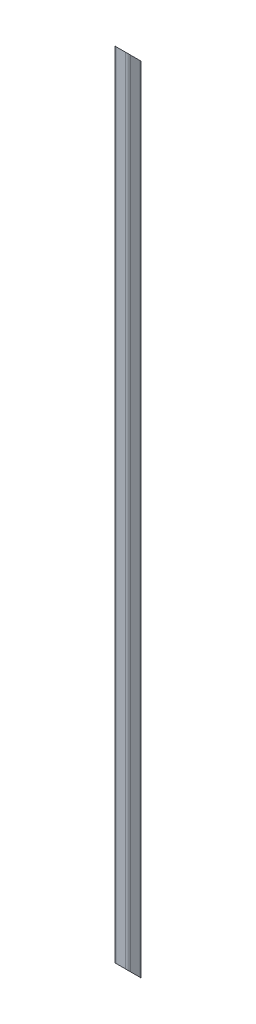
from build123d import *

# Parameters (mm, degrees)
EXTRUDE_THIN1_DEPTH = 2120.9
EXTRUDE1_DEPTH      = 2122.327726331


with BuildPart() as part:
    # Sketch1 → Extrude-Thin1 (new body)
    with BuildSketch(Plane(origin=(0, 0, 0), x_dir=(1, 0, 0), z_dir=(0, 1, 0))):
        with BuildLine():
            Line((-12.97432, 19.05), (12.97432, 19.05))
            ThreePointArc((12.97432, 19.05), (17.270474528, 17.270474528), (19.05, 12.97432))
            Line((19.05, 12.97432), (19.05, -12.97432))
            ThreePointArc((19.05, -12.97432), (17.270474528, -17.270474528), (12.97432, -19.05))
            Line((12.97432, -19.05), (-12.97432, -19.05))
            ThreePointArc((-12.97432, -19.05), (-17.270474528, -17.270474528), (-19.05, -12.97432))
            Line((-19.05, -12.97432), (-19.05, 12.97432))
            ThreePointArc((-19.05, 12.97432), (-17.270474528, 17.270474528), (-12.97432, 19.05))
        make_face()
        with BuildLine():
            Line((-12.97432, 16.01216), (12.97432, 16.01216))
            ThreePointArc((12.97432, 16.01216), (15.122397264, 15.122397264), (16.01216, 12.97432))
            Line((16.01216, 12.97432), (16.01216, -12.97432))
            ThreePointArc((16.01216, -12.97432), (15.122397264, -15.122397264), (12.97432, -16.01216))
            Line((12.97432, -16.01216), (-12.97432, -16.01216))
            ThreePointArc((-12.97432, -16.01216), (-15.122397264, -15.122397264), (-16.01216, -12.97432))
            Line((-16.01216, -12.97432), (-16.01216, 12.97432))
            ThreePointArc((-16.01216, 12.97432), (-15.122397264, 15.122397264), (-12.97432, 16.01216))
        make_face(mode=Mode.SUBTRACT)
    extrude(amount=EXTRUDE_THIN1_DEPTH)

    # Sketch2 → Extrude1 (cut, through all)
    with BuildSketch(Plane.ZY.offset(19.05)):
        Polygon((-19.05, 0), (19.05, 38.1), (19.05, 0), align=None)
        Polygon((-19.05, 2082.8), (19.05, 2120.9), (-19.05, 2120.9), align=None)
    extrude(amount=-EXTRUDE1_DEPTH, mode=Mode.SUBTRACT)


solid = part.part
